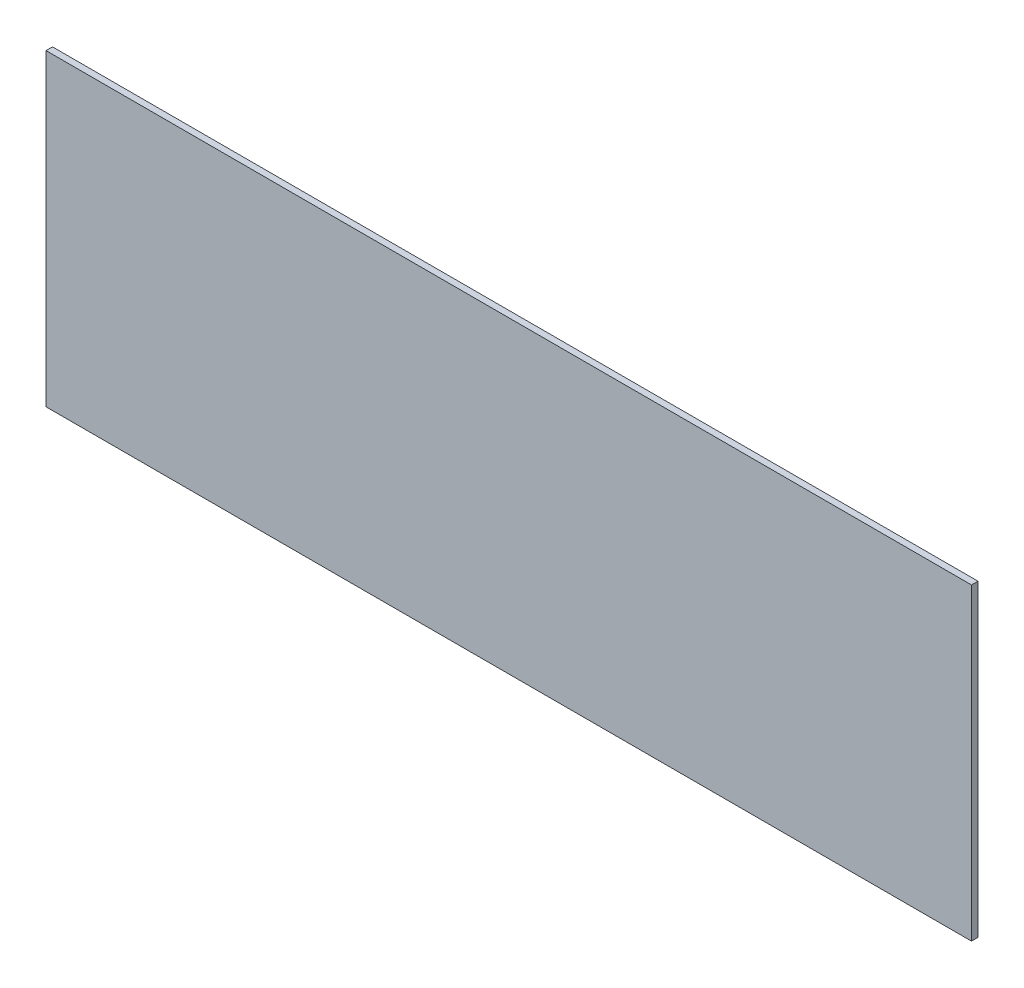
ISO-10303-21;
HEADER;
FILE_DESCRIPTION(('STEP AP214'),'2;1');
FILE_NAME('part.step','',(''),(''),'','','');
FILE_SCHEMA(('AUTOMOTIVE_DESIGN { 1 0 10303 214 1 1 1 1 }'));
ENDSEC;
DATA;
#1=APPLICATION_CONTEXT('core data for automotive mechanical design processes');
#2=APPLICATION_PROTOCOL_DEFINITION('international standard','automotive_design',2000,#1);
#3=PRODUCT_CONTEXT('',#1,'mechanical');
#4=PRODUCT('Part','Part','',(#3));
#5=PRODUCT_RELATED_PRODUCT_CATEGORY('part','',(#4));
#6=PRODUCT_DEFINITION_FORMATION('','',#4);
#7=PRODUCT_DEFINITION_CONTEXT('part definition',#1,'design');
#8=PRODUCT_DEFINITION('design','',#6,#7);
#9=PRODUCT_DEFINITION_SHAPE('','',#8);
#10=(LENGTH_UNIT() NAMED_UNIT(*) SI_UNIT(.MILLI.,.METRE.));
#11=(NAMED_UNIT(*) PLANE_ANGLE_UNIT() SI_UNIT($,.RADIAN.));
#12=(NAMED_UNIT(*) SI_UNIT($,.STERADIAN.) SOLID_ANGLE_UNIT());
#13=UNCERTAINTY_MEASURE_WITH_UNIT(LENGTH_MEASURE(1.E-05),#10,'distance_accuracy_value','');
#14=(GEOMETRIC_REPRESENTATION_CONTEXT(3) GLOBAL_UNCERTAINTY_ASSIGNED_CONTEXT((#13)) GLOBAL_UNIT_ASSIGNED_CONTEXT((#10,
#11,#12)) REPRESENTATION_CONTEXT('',''));
#15=CARTESIAN_POINT('',(0.,0.,0.));
#16=DIRECTION('',(0.,0.,1.));
#17=DIRECTION('',(1.,0.,0.));
#18=AXIS2_PLACEMENT_3D('',#15,#16,#17);
#19=CARTESIAN_POINT('',(0.,0.,1.6002));
#20=DIRECTION('',(1.,0.,0.));
#21=DIRECTION('',(0.,0.,-1.));
#22=AXIS2_PLACEMENT_3D('',#19,#20,#21);
#23=PLANE('',#22);
#24=DIRECTION('',(0.,-1.,0.));
#25=VECTOR('',#24,1.);
#26=CARTESIAN_POINT('',(0.,0.,0.));
#27=LINE('',#26,#25);
#28=CARTESIAN_POINT('',(0.,76.2,0.));
#29=VERTEX_POINT('',#28);
#30=CARTESIAN_POINT('',(0.,0.,0.));
#31=VERTEX_POINT('',#30);
#32=EDGE_CURVE('E94',#29,#31,#27,.T.);
#33=ORIENTED_EDGE('',*,*,#32,.T.);
#34=DIRECTION('',(0.,0.,-1.));
#35=VECTOR('',#34,1.);
#36=CARTESIAN_POINT('',(0.,0.,1.6002));
#37=LINE('',#36,#35);
#38=CARTESIAN_POINT('',(0.,0.,1.6002));
#39=VERTEX_POINT('',#38);
#40=EDGE_CURVE('E11',#39,#31,#37,.T.);
#41=ORIENTED_EDGE('',*,*,#40,.F.);
#42=DIRECTION('',(0.,-1.,0.));
#43=VECTOR('',#42,1.);
#44=CARTESIAN_POINT('',(0.,0.,1.6002));
#45=LINE('',#44,#43);
#46=CARTESIAN_POINT('',(0.,76.2,1.6002));
#47=VERTEX_POINT('',#46);
#48=EDGE_CURVE('E82',#47,#39,#45,.T.);
#49=ORIENTED_EDGE('',*,*,#48,.F.);
#50=DIRECTION('',(0.,0.,-1.));
#51=VECTOR('',#50,1.);
#52=CARTESIAN_POINT('',(0.,76.2,1.6002));
#53=LINE('',#52,#51);
#54=EDGE_CURVE('E90',#47,#29,#53,.T.);
#55=ORIENTED_EDGE('',*,*,#54,.T.);
#56=EDGE_LOOP('',(#33,#41,#49,#55));
#57=FACE_BOUND('',#56,.T.);
#58=ADVANCED_FACE('F31',(#57),#23,.F.);
#59=CARTESIAN_POINT('',(0.,0.,1.6002));
#60=DIRECTION('',(0.,1.,0.));
#61=DIRECTION('',(0.,0.,1.));
#62=AXIS2_PLACEMENT_3D('',#59,#60,#61);
#63=PLANE('',#62);
#64=DIRECTION('',(1.,0.,0.));
#65=VECTOR('',#64,1.);
#66=CARTESIAN_POINT('',(0.,0.,0.));
#67=LINE('',#66,#65);
#68=CARTESIAN_POINT('',(228.6,0.,0.));
#69=VERTEX_POINT('',#68);
#70=EDGE_CURVE('E86',#31,#69,#67,.T.);
#71=ORIENTED_EDGE('',*,*,#70,.T.);
#72=DIRECTION('',(0.,0.,-1.));
#73=VECTOR('',#72,1.);
#74=CARTESIAN_POINT('',(228.6,0.,1.6002));
#75=LINE('',#74,#73);
#76=CARTESIAN_POINT('',(228.6,0.,1.6002));
#77=VERTEX_POINT('',#76);
#78=EDGE_CURVE('E39',#77,#69,#75,.T.);
#79=ORIENTED_EDGE('',*,*,#78,.F.);
#80=DIRECTION('',(1.,0.,0.));
#81=VECTOR('',#80,1.);
#82=CARTESIAN_POINT('',(0.,0.,1.6002));
#83=LINE('',#82,#81);
#84=EDGE_CURVE('E77',#39,#77,#83,.T.);
#85=ORIENTED_EDGE('',*,*,#84,.F.);
#86=ORIENTED_EDGE('',*,*,#40,.T.);
#87=EDGE_LOOP('',(#71,#79,#85,#86));
#88=FACE_BOUND('',#87,.T.);
#89=ADVANCED_FACE('F85',(#88),#63,.F.);
#90=CARTESIAN_POINT('',(228.6,0.,1.6002));
#91=DIRECTION('',(-1.,0.,0.));
#92=DIRECTION('',(0.,0.,1.));
#93=AXIS2_PLACEMENT_3D('',#90,#91,#92);
#94=PLANE('',#93);
#95=DIRECTION('',(0.,1.,0.));
#96=VECTOR('',#95,1.);
#97=CARTESIAN_POINT('',(228.6,0.,0.));
#98=LINE('',#97,#96);
#99=CARTESIAN_POINT('',(228.6,76.2,0.));
#100=VERTEX_POINT('',#99);
#101=EDGE_CURVE('E64',#69,#100,#98,.T.);
#102=ORIENTED_EDGE('',*,*,#101,.T.);
#103=DIRECTION('',(0.,0.,-1.));
#104=VECTOR('',#103,1.);
#105=CARTESIAN_POINT('',(228.6,76.2,1.6002));
#106=LINE('',#105,#104);
#107=CARTESIAN_POINT('',(228.6,76.2,1.6002));
#108=VERTEX_POINT('',#107);
#109=EDGE_CURVE('E87',#108,#100,#106,.T.);
#110=ORIENTED_EDGE('',*,*,#109,.F.);
#111=DIRECTION('',(0.,1.,0.));
#112=VECTOR('',#111,1.);
#113=CARTESIAN_POINT('',(228.6,0.,1.6002));
#114=LINE('',#113,#112);
#115=EDGE_CURVE('E80',#77,#108,#114,.T.);
#116=ORIENTED_EDGE('',*,*,#115,.F.);
#117=ORIENTED_EDGE('',*,*,#78,.T.);
#118=EDGE_LOOP('',(#102,#110,#116,#117));
#119=FACE_BOUND('',#118,.T.);
#120=ADVANCED_FACE('F88',(#119),#94,.F.);
#121=CARTESIAN_POINT('',(0.,76.2,1.6002));
#122=DIRECTION('',(0.,-1.,0.));
#123=DIRECTION('',(0.,0.,-1.));
#124=AXIS2_PLACEMENT_3D('',#121,#122,#123);
#125=PLANE('',#124);
#126=DIRECTION('',(-1.,0.,0.));
#127=VECTOR('',#126,1.);
#128=CARTESIAN_POINT('',(0.,76.2,0.));
#129=LINE('',#128,#127);
#130=EDGE_CURVE('E70',#100,#29,#129,.T.);
#131=ORIENTED_EDGE('',*,*,#130,.T.);
#132=ORIENTED_EDGE('',*,*,#54,.F.);
#133=DIRECTION('',(-1.,0.,0.));
#134=VECTOR('',#133,1.);
#135=CARTESIAN_POINT('',(0.,76.2,1.6002));
#136=LINE('',#135,#134);
#137=EDGE_CURVE('E47',#108,#47,#136,.T.);
#138=ORIENTED_EDGE('',*,*,#137,.F.);
#139=ORIENTED_EDGE('',*,*,#109,.T.);
#140=EDGE_LOOP('',(#131,#132,#138,#139));
#141=FACE_BOUND('',#140,.T.);
#142=ADVANCED_FACE('F101',(#141),#125,.F.);
#143=CARTESIAN_POINT('',(0.,76.2,1.6002));
#144=DIRECTION('',(0.,0.,-1.));
#145=DIRECTION('',(-1.,0.,0.));
#146=AXIS2_PLACEMENT_3D('',#143,#144,#145);
#147=PLANE('',#146);
#148=ORIENTED_EDGE('',*,*,#48,.T.);
#149=ORIENTED_EDGE('',*,*,#84,.T.);
#150=ORIENTED_EDGE('',*,*,#115,.T.);
#151=ORIENTED_EDGE('',*,*,#137,.T.);
#152=EDGE_LOOP('',(#148,#149,#150,#151));
#153=FACE_BOUND('',#152,.T.);
#154=ADVANCED_FACE('F78',(#153),#147,.F.);
#155=CARTESIAN_POINT('',(0.,76.2,0.));
#156=DIRECTION('',(0.,0.,-1.));
#157=DIRECTION('',(-1.,0.,0.));
#158=AXIS2_PLACEMENT_3D('',#155,#156,#157);
#159=PLANE('',#158);
#160=ORIENTED_EDGE('',*,*,#32,.F.);
#161=ORIENTED_EDGE('',*,*,#130,.F.);
#162=ORIENTED_EDGE('',*,*,#101,.F.);
#163=ORIENTED_EDGE('',*,*,#70,.F.);
#164=EDGE_LOOP('',(#160,#161,#162,#163));
#165=FACE_BOUND('',#164,.T.);
#166=ADVANCED_FACE('F104',(#165),#159,.T.);
#167=CLOSED_SHELL('',(#58,#89,#120,#142,#154,#166));
#168=MANIFOLD_SOLID_BREP('B2',#167);
#169=ADVANCED_BREP_SHAPE_REPRESENTATION('',(#18,#168),#14);
#170=SHAPE_DEFINITION_REPRESENTATION(#9,#169);
ENDSEC;
END-ISO-10303-21;
